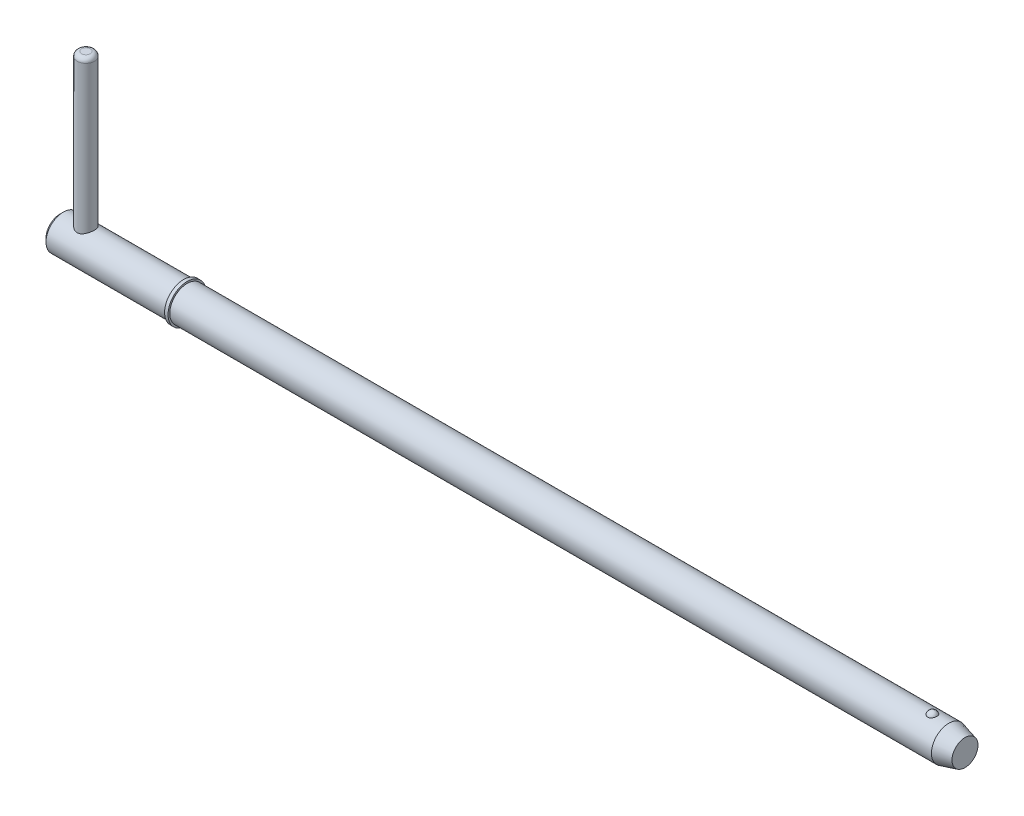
ISO-10303-21;
HEADER;
FILE_DESCRIPTION(('STEP AP214'),'2;1');
FILE_NAME('part.step','',(''),(''),'','','');
FILE_SCHEMA(('AUTOMOTIVE_DESIGN { 1 0 10303 214 1 1 1 1 }'));
ENDSEC;
DATA;
#1=APPLICATION_CONTEXT('core data for automotive mechanical design processes');
#2=APPLICATION_PROTOCOL_DEFINITION('international standard','automotive_design',2000,#1);
#3=PRODUCT_CONTEXT('',#1,'mechanical');
#4=PRODUCT('Part','Part','',(#3));
#5=PRODUCT_RELATED_PRODUCT_CATEGORY('part','',(#4));
#6=PRODUCT_DEFINITION_FORMATION('','',#4);
#7=PRODUCT_DEFINITION_CONTEXT('part definition',#1,'design');
#8=PRODUCT_DEFINITION('design','',#6,#7);
#9=PRODUCT_DEFINITION_SHAPE('','',#8);
#10=(LENGTH_UNIT() NAMED_UNIT(*) SI_UNIT(.MILLI.,.METRE.));
#11=(NAMED_UNIT(*) PLANE_ANGLE_UNIT() SI_UNIT($,.RADIAN.));
#12=(NAMED_UNIT(*) SI_UNIT($,.STERADIAN.) SOLID_ANGLE_UNIT());
#13=UNCERTAINTY_MEASURE_WITH_UNIT(LENGTH_MEASURE(1.E-05),#10,'distance_accuracy_value','');
#14=(GEOMETRIC_REPRESENTATION_CONTEXT(3) GLOBAL_UNCERTAINTY_ASSIGNED_CONTEXT((#13)) GLOBAL_UNIT_ASSIGNED_CONTEXT((#10,
#11,#12)) REPRESENTATION_CONTEXT('',''));
#15=CARTESIAN_POINT('',(0.,0.,0.));
#16=DIRECTION('',(0.,0.,1.));
#17=DIRECTION('',(1.,0.,0.));
#18=AXIS2_PLACEMENT_3D('',#15,#16,#17);
#19=CARTESIAN_POINT('',(3.57,23.02,0.));
#20=DIRECTION('',(0.,-1.,0.));
#21=DIRECTION('',(0.,0.,-1.));
#22=AXIS2_PLACEMENT_3D('',#19,#20,#21);
#23=CYLINDRICAL_SURFACE('',#22,1.19);
#24=CARTESIAN_POINT('',(3.57,-1.785,0.));
#25=DIRECTION('',(0.,1.,0.));
#26=DIRECTION('',(0.,0.,1.));
#27=AXIS2_PLACEMENT_3D('',#24,#25,#26);
#28=CIRCLE('',#27,1.19);
#29=CARTESIAN_POINT('',(3.57,-1.785,1.19));
#30=VERTEX_POINT('',#29);
#31=EDGE_CURVE('P0_E25',#30,#30,#28,.T.);
#32=ORIENTED_EDGE('',*,*,#31,.T.);
#33=EDGE_LOOP('',(#32));
#34=FACE_BOUND('',#33,.T.);
#35=CARTESIAN_POINT('',(3.57,22.425,0.));
#36=DIRECTION('',(0.,1.,0.));
#37=DIRECTION('',(0.,0.,1.));
#38=AXIS2_PLACEMENT_3D('',#35,#36,#37);
#39=CIRCLE('',#38,1.19);
#40=CARTESIAN_POINT('',(3.57,22.425,1.19));
#41=VERTEX_POINT('',#40);
#42=EDGE_CURVE('P0_E29',#41,#41,#39,.F.);
#43=ORIENTED_EDGE('',*,*,#42,.T.);
#44=EDGE_LOOP('',(#43));
#45=FACE_BOUND('',#44,.T.);
#46=ADVANCED_FACE('P0_F14',(#34,#45),#23,.T.);
#47=CARTESIAN_POINT('',(3.57,23.02,0.));
#48=DIRECTION('',(0.,1.,0.));
#49=DIRECTION('',(0.,0.,1.));
#50=AXIS2_PLACEMENT_3D('',#47,#48,#49);
#51=PLANE('',#50);
#52=CARTESIAN_POINT('',(3.57,23.02,0.));
#53=DIRECTION('',(0.,1.,0.));
#54=DIRECTION('',(0.,0.,1.));
#55=AXIS2_PLACEMENT_3D('',#52,#53,#54);
#56=CIRCLE('',#55,0.595);
#57=CARTESIAN_POINT('',(3.57,23.02,0.595));
#58=VERTEX_POINT('',#57);
#59=EDGE_CURVE('P0_E10',#58,#58,#56,.T.);
#60=ORIENTED_EDGE('',*,*,#59,.T.);
#61=EDGE_LOOP('',(#60));
#62=FACE_BOUND('',#61,.T.);
#63=ADVANCED_FACE('P0_F46',(#62),#51,.T.);
#64=CARTESIAN_POINT('',(3.57,-2.38,0.));
#65=DIRECTION('',(0.,1.,0.));
#66=DIRECTION('',(0.,0.,1.));
#67=AXIS2_PLACEMENT_3D('',#64,#65,#66);
#68=PLANE('',#67);
#69=CARTESIAN_POINT('',(3.57,-2.38,0.));
#70=DIRECTION('',(0.,1.,0.));
#71=DIRECTION('',(0.,0.,1.));
#72=AXIS2_PLACEMENT_3D('',#69,#70,#71);
#73=CIRCLE('',#72,0.595);
#74=CARTESIAN_POINT('',(3.57,-2.38,0.595));
#75=VERTEX_POINT('',#74);
#76=EDGE_CURVE('P0_E21',#75,#75,#73,.F.);
#77=ORIENTED_EDGE('',*,*,#76,.T.);
#78=EDGE_LOOP('',(#77));
#79=FACE_BOUND('',#78,.T.);
#80=ADVANCED_FACE('P0_F43',(#79),#68,.F.);
#81=CARTESIAN_POINT('',(3.57,-1.785,0.));
#82=DIRECTION('',(0.,1.,0.));
#83=DIRECTION('',(0.,0.,1.));
#84=AXIS2_PLACEMENT_3D('',#81,#82,#83);
#85=DEGENERATE_TOROIDAL_SURFACE('',#84,0.595,0.595,.T.);
#86=ORIENTED_EDGE('',*,*,#76,.F.);
#87=EDGE_LOOP('',(#86));
#88=FACE_BOUND('',#87,.T.);
#89=ORIENTED_EDGE('',*,*,#31,.F.);
#90=EDGE_LOOP('',(#89));
#91=FACE_BOUND('',#90,.T.);
#92=ADVANCED_FACE('P0_F38',(#88,#91),#85,.T.);
#93=CARTESIAN_POINT('',(3.57,22.425,0.));
#94=DIRECTION('',(0.,1.,0.));
#95=DIRECTION('',(0.,0.,1.));
#96=AXIS2_PLACEMENT_3D('',#93,#94,#95);
#97=DEGENERATE_TOROIDAL_SURFACE('',#96,0.595,0.595,.T.);
#98=ORIENTED_EDGE('',*,*,#42,.F.);
#99=EDGE_LOOP('',(#98));
#100=FACE_BOUND('',#99,.T.);
#101=ORIENTED_EDGE('',*,*,#59,.F.);
#102=EDGE_LOOP('',(#101));
#103=FACE_BOUND('',#102,.T.);
#104=ADVANCED_FACE('P0_F16',(#100,#103),#97,.T.);
#105=CLOSED_SHELL('',(#46,#63,#80,#92,#104));
#106=MANIFOLD_SOLID_BREP('P0_B1',#105);
#107=CARTESIAN_POINT('',(0.,0.,0.));
#108=DIRECTION('',(1.,0.,0.));
#109=DIRECTION('',(0.,0.,-1.));
#110=AXIS2_PLACEMENT_3D('',#107,#108,#109);
#111=CYLINDRICAL_SURFACE('',#110,2.38);
#112=CARTESIAN_POINT('',(121.909429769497,0.,0.));
#113=DIRECTION('',(1.,0.,0.));
#114=DIRECTION('',(0.,0.,-1.));
#115=AXIS2_PLACEMENT_3D('',#112,#113,#114);
#116=CIRCLE('',#115,2.38);
#117=CARTESIAN_POINT('',(121.909429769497,0.,-2.38));
#118=VERTEX_POINT('',#117);
#119=EDGE_CURVE('P1_E81',#118,#118,#116,.T.);
#120=ORIENTED_EDGE('',*,*,#119,.F.);
#121=EDGE_LOOP('',(#120));
#122=FACE_BOUND('',#121,.T.);
#123=CARTESIAN_POINT('',(17.45,0.,0.));
#124=DIRECTION('',(1.,0.,0.));
#125=DIRECTION('',(0.,0.,-1.));
#126=AXIS2_PLACEMENT_3D('',#123,#124,#125);
#127=CIRCLE('',#126,2.38);
#128=CARTESIAN_POINT('',(17.45,0.,-2.38));
#129=VERTEX_POINT('',#128);
#130=EDGE_CURVE('P1_E85',#129,#129,#127,.T.);
#131=ORIENTED_EDGE('',*,*,#130,.T.);
#132=EDGE_LOOP('',(#131));
#133=FACE_BOUND('',#132,.T.);
#134=CARTESIAN_POINT('',(119.663449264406,2.2921568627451,0.640637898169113));
#135=CARTESIAN_POINT('',(119.630355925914,2.29215737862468,0.64063719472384));
#136=CARTESIAN_POINT('',(119.597254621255,2.29293179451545,0.637884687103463));
#137=CARTESIAN_POINT('',(119.532017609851,2.29594030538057,0.626968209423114));
#138=CARTESIAN_POINT('',(119.499882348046,2.29817506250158,0.618801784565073));
#139=CARTESIAN_POINT('',(119.437540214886,2.3038430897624,0.597351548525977));
#140=CARTESIAN_POINT('',(119.40733051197,2.30727454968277,0.584075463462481));
#141=CARTESIAN_POINT('',(119.349567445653,2.31495941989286,0.552829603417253));
#142=CARTESIAN_POINT('',(119.32201418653,2.31921286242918,0.534859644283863));
#143=CARTESIAN_POINT('',(119.269593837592,2.32820213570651,0.494282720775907));
#144=CARTESIAN_POINT('',(119.244805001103,2.33294694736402,0.471576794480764));
#145=CARTESIAN_POINT('',(119.199216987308,2.34234144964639,0.422446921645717));
#146=CARTESIAN_POINT('',(119.178418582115,2.34699112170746,0.396022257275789));
#147=CARTESIAN_POINT('',(119.14035804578,2.35593942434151,0.338855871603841));
#148=CARTESIAN_POINT('',(119.123305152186,2.36021170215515,0.307970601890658));
#149=CARTESIAN_POINT('',(119.0943607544,2.3677057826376,0.243750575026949));
#150=CARTESIAN_POINT('',(119.0824701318,2.37092740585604,0.210415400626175));
#151=CARTESIAN_POINT('',(119.063807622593,2.37606901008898,0.141189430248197));
#152=CARTESIAN_POINT('',(119.057195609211,2.37794816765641,0.105252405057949));
#153=CARTESIAN_POINT('',(119.049809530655,2.38005135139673,0.032735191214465));
#154=CARTESIAN_POINT('',(119.049035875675,2.38027526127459,-0.00384504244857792));
#155=CARTESIAN_POINT('',(119.053362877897,2.37903842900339,-0.0769838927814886));
#156=CARTESIAN_POINT('',(119.05852028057,2.37756141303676,-0.113538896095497));
#157=CARTESIAN_POINT('',(119.074701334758,2.37305303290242,-0.185229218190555));
#158=CARTESIAN_POINT('',(119.085725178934,2.37002161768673,-0.220364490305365));
#159=CARTESIAN_POINT('',(119.113397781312,2.36273722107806,-0.288156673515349));
#160=CARTESIAN_POINT('',(119.130038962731,2.35848588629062,-0.320816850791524));
#161=CARTESIAN_POINT('',(119.168598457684,2.34923130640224,-0.382744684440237));
#162=CARTESIAN_POINT('',(119.190516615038,2.34422808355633,-0.412012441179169));
#163=CARTESIAN_POINT('',(119.238754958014,2.33412555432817,-0.465830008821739));
#164=CARTESIAN_POINT('',(119.265002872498,2.32902887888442,-0.490444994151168));
#165=CARTESIAN_POINT('',(119.321476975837,2.31926941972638,-0.534700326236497));
#166=CARTESIAN_POINT('',(119.351702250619,2.3146065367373,-0.554341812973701));
#167=CARTESIAN_POINT('',(119.414061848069,2.30645675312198,-0.587312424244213));
#168=CARTESIAN_POINT('',(119.446078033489,2.30293152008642,-0.600855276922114));
#169=CARTESIAN_POINT('',(119.512079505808,2.29725171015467,-0.622220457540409));
#170=CARTESIAN_POINT('',(119.546064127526,2.29509667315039,-0.630044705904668));
#171=CARTESIAN_POINT('',(119.613299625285,2.29249264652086,-0.639452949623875));
#172=CARTESIAN_POINT('',(119.646508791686,2.29196755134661,-0.641315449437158));
#173=CARTESIAN_POINT('',(119.712763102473,2.29246849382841,-0.63952261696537));
#174=CARTESIAN_POINT('',(119.745808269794,2.29349430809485,-0.635868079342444));
#175=CARTESIAN_POINT('',(119.810102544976,2.29694059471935,-0.623301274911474));
#176=CARTESIAN_POINT('',(119.841374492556,2.29933234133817,-0.614497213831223));
#177=CARTESIAN_POINT('',(119.901995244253,2.30522511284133,-0.592006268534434));
#178=CARTESIAN_POINT('',(119.931343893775,2.30872622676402,-0.578318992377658));
#179=CARTESIAN_POINT('',(119.988036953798,2.31655795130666,-0.546112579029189));
#180=CARTESIAN_POINT('',(120.015320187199,2.32090569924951,-0.52749010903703));
#181=CARTESIAN_POINT('',(120.066490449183,2.3299220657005,-0.486117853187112));
#182=CARTESIAN_POINT('',(120.090376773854,2.33459075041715,-0.463367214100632));
#183=CARTESIAN_POINT('',(120.135272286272,2.34399834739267,-0.41322006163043));
#184=CARTESIAN_POINT('',(120.156097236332,2.34873051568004,-0.38565730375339));
#185=CARTESIAN_POINT('',(120.193056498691,2.35754932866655,-0.327455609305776));
#186=CARTESIAN_POINT('',(120.209189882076,2.36163584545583,-0.296816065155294));
#187=CARTESIAN_POINT('',(120.2369822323,2.36889321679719,-0.232047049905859));
#188=CARTESIAN_POINT('',(120.248445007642,2.37202275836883,-0.197828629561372));
#189=CARTESIAN_POINT('',(120.265752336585,2.37681926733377,-0.127900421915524));
#190=CARTESIAN_POINT('',(120.271596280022,2.37848607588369,-0.092190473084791));
#191=CARTESIAN_POINT('',(120.277605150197,2.38020024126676,-0.0196348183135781));
#192=CARTESIAN_POINT('',(120.27767043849,2.38021918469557,0.0172198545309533));
#193=CARTESIAN_POINT('',(120.271868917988,2.37856356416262,0.0904219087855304));
#194=CARTESIAN_POINT('',(120.266001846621,2.37688892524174,0.126769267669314));
#195=CARTESIAN_POINT('',(120.248425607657,2.37201688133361,0.198028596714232));
#196=CARTESIAN_POINT('',(120.236699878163,2.36881516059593,0.232936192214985));
#197=CARTESIAN_POINT('',(120.20763544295,2.36123444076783,0.300196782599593));
#198=CARTESIAN_POINT('',(120.190296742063,2.3568554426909,0.332549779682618));
#199=CARTESIAN_POINT('',(120.150535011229,2.34744667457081,0.39349541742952));
#200=CARTESIAN_POINT('',(120.128152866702,2.34242227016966,0.422115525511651));
#201=CARTESIAN_POINT('',(120.078739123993,2.33227293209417,0.475004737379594));
#202=CARTESIAN_POINT('',(120.051707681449,2.32714800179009,0.499273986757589));
#203=CARTESIAN_POINT('',(119.994498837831,2.31755359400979,0.542046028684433));
#204=CARTESIAN_POINT('',(119.96442973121,2.3130698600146,0.560690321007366));
#205=CARTESIAN_POINT('',(119.901386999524,2.30514125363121,0.592447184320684));
#206=CARTESIAN_POINT('',(119.868415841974,2.30169550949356,0.605564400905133));
#207=CARTESIAN_POINT('',(119.806842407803,2.29677744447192,0.623927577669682));
#208=CARTESIAN_POINT('',(119.778555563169,2.295058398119,0.630178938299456));
#209=CARTESIAN_POINT('',(119.721330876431,2.29274795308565,0.638534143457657));
#210=CARTESIAN_POINT('',(119.692393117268,2.29215641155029,0.640638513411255));
#211=CARTESIAN_POINT('',(119.663449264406,2.2921568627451,0.640637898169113));
#212=B_SPLINE_CURVE_WITH_KNOTS('',3,(#134,#135,#136,#137,#138,#139,#140,#141,#142,#143,#144,
#145,#146,#147,#148,#149,#150,#151,#152,#153,#154,#155,#156,#157,#158,#159,#160,#161,#162,#163,
#164,#165,#166,#167,#168,#169,#170,#171,#172,#173,#174,#175,#176,#177,#178,#179,#180,#181,#182,
#183,#184,#185,#186,#187,#188,#189,#190,#191,#192,#193,#194,#195,#196,#197,#198,#199,#200,#201,
#202,#203,#204,#205,#206,#207,#208,#209,#210,#211),.UNSPECIFIED.,.T.,.F.,(4,2,2,2,2,2,2,2,2,2,2,
2,2,2,2,2,2,2,2,2,2,2,2,2,2,2,2,2,2,2,2,2,2,2,2,2,2,2,4),(0.,0.0991724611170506,
0.198389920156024,0.297457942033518,0.396529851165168,0.497927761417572,0.59934527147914,
0.70547553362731,0.811623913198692,0.920876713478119,1.03013718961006,1.14045177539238,
1.25076998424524,1.36093998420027,1.47110672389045,1.57959248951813,1.68805336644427,
1.79234266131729,1.89659691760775,1.9959039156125,2.09519661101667,2.19247425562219,
2.2897597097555,2.38926978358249,2.48880044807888,2.59293588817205,2.69709193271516,
2.80525821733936,2.91343624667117,3.0234791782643,3.13352698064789,3.24388765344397,
3.35424823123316,3.46374443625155,3.5732369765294,3.67968690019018,3.78604717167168,
3.87279565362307,3.9595331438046),.UNSPECIFIED.);
#213=CARTESIAN_POINT('',(119.663449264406,2.2921568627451,0.640637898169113));
#214=VERTEX_POINT('',#213);
#215=EDGE_CURVE('P1_E35',#214,#214,#212,.T.);
#216=ORIENTED_EDGE('',*,*,#215,.T.);
#217=EDGE_LOOP('',(#216));
#218=FACE_BOUND('',#217,.T.);
#219=ADVANCED_FACE('P1_F13',(#122,#133,#218),#111,.T.);
#220=CARTESIAN_POINT('',(0.,0.,0.));
#221=DIRECTION('',(-1.,0.,0.));
#222=DIRECTION('',(0.,0.,1.));
#223=AXIS2_PLACEMENT_3D('',#220,#221,#222);
#224=PLANE('',#223);
#225=CARTESIAN_POINT('',(0.,0.,0.));
#226=DIRECTION('',(1.,0.,0.));
#227=DIRECTION('',(0.,0.,-1.));
#228=AXIS2_PLACEMENT_3D('',#225,#226,#227);
#229=CIRCLE('',#228,1.904);
#230=CARTESIAN_POINT('',(0.,0.,-1.904));
#231=VERTEX_POINT('',#230);
#232=EDGE_CURVE('P1_E9',#231,#231,#229,.T.);
#233=ORIENTED_EDGE('',*,*,#232,.F.);
#234=EDGE_LOOP('',(#233));
#235=FACE_BOUND('',#234,.T.);
#236=ADVANCED_FACE('P1_F15',(#235),#224,.T.);
#237=CARTESIAN_POINT('',(0.475999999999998,0.,0.));
#238=DIRECTION('',(1.,0.,0.));
#239=DIRECTION('',(0.,0.,-1.));
#240=AXIS2_PLACEMENT_3D('',#237,#238,#239);
#241=CONICAL_SURFACE('',#240,2.38,0.78539816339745);
#242=ORIENTED_EDGE('',*,*,#232,.T.);
#243=EDGE_LOOP('',(#242));
#244=FACE_BOUND('',#243,.T.);
#245=CARTESIAN_POINT('',(0.475999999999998,0.,0.));
#246=DIRECTION('',(1.,0.,0.));
#247=DIRECTION('',(0.,0.,-1.));
#248=AXIS2_PLACEMENT_3D('',#245,#246,#247);
#249=CIRCLE('',#248,2.38);
#250=CARTESIAN_POINT('',(0.475999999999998,0.,-2.38));
#251=VERTEX_POINT('',#250);
#252=EDGE_CURVE('P1_E26',#251,#251,#249,.T.);
#253=ORIENTED_EDGE('',*,*,#252,.F.);
#254=EDGE_LOOP('',(#253));
#255=FACE_BOUND('',#254,.T.);
#256=ADVANCED_FACE('P1_F77',(#244,#255),#241,.T.);
#257=CARTESIAN_POINT('',(0.,0.,0.));
#258=DIRECTION('',(1.,0.,0.));
#259=DIRECTION('',(0.,0.,-1.));
#260=AXIS2_PLACEMENT_3D('',#257,#258,#259);
#261=CYLINDRICAL_SURFACE('',#260,2.38);
#262=CARTESIAN_POINT('',(3.57,-2.06114046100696,1.19));
#263=CARTESIAN_POINT('',(3.50799170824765,-2.06114586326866,1.18999567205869));
#264=CARTESIAN_POINT('',(3.4459051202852,-2.0639812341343,1.18512096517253));
#265=CARTESIAN_POINT('',(3.32363755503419,-2.07491216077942,1.16587061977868));
#266=CARTESIAN_POINT('',(3.26346086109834,-2.08301876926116,1.15147501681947));
#267=CARTESIAN_POINT('',(3.14701251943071,-2.10331722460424,1.11395893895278));
#268=CARTESIAN_POINT('',(3.09072196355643,-2.1154873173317,1.09088484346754));
#269=CARTESIAN_POINT('',(2.9828251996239,-2.14250771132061,1.03680835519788));
#270=CARTESIAN_POINT('',(2.93121924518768,-2.15735815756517,1.00580553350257));
#271=CARTESIAN_POINT('',(2.82945618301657,-2.18956274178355,0.933753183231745));
#272=CARTESIAN_POINT('',(2.77976962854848,-2.20702235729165,0.892085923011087));
#273=CARTESIAN_POINT('',(2.68772401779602,-2.2416265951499,0.801172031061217));
#274=CARTESIAN_POINT('',(2.64536861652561,-2.25877105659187,0.751921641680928));
#275=CARTESIAN_POINT('',(2.56639309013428,-2.29219557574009,0.64318258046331));
#276=CARTESIAN_POINT('',(2.53035201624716,-2.30833946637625,0.583227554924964));
#277=CARTESIAN_POINT('',(2.46908238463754,-2.3365739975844,0.45714686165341));
#278=CARTESIAN_POINT('',(2.44384700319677,-2.34866719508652,0.391025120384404));
#279=CARTESIAN_POINT('',(2.40676945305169,-2.36667748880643,0.259473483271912));
#280=CARTESIAN_POINT('',(2.39410206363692,-2.37297281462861,0.194329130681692));
#281=CARTESIAN_POINT('',(2.3798023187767,-2.3800902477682,0.0625590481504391));
#282=CARTESIAN_POINT('',(2.37816328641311,-2.38091566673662,-0.00406576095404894));
#283=CARTESIAN_POINT('',(2.38564854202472,-2.37717948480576,-0.130700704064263));
#284=CARTESIAN_POINT('',(2.39384923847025,-2.37308010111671,-0.190782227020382));
#285=CARTESIAN_POINT('',(2.41912820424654,-2.360653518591,-0.308583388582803));
#286=CARTESIAN_POINT('',(2.43620713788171,-2.35232600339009,-0.366302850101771));
#287=CARTESIAN_POINT('',(2.47886825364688,-2.33206184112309,-0.478748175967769));
#288=CARTESIAN_POINT('',(2.50456481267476,-2.32007685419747,-0.533421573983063));
#289=CARTESIAN_POINT('',(2.56357346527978,-2.29357798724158,-0.637812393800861));
#290=CARTESIAN_POINT('',(2.5968882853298,-2.27906320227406,-0.687528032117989));
#291=CARTESIAN_POINT('',(2.67380546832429,-2.24724829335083,-0.785606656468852));
#292=CARTESIAN_POINT('',(2.71808260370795,-2.22981457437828,-0.833397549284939));
#293=CARTESIAN_POINT('',(2.81386177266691,-2.19500665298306,-0.921184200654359));
#294=CARTESIAN_POINT('',(2.86536931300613,-2.17763250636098,-0.961173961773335));
#295=CARTESIAN_POINT('',(2.97815134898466,-2.14371545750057,-1.03471134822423));
#296=CARTESIAN_POINT('',(3.03983836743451,-2.12729540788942,-1.06768860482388));
#297=CARTESIAN_POINT('',(3.16889582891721,-2.09886785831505,-1.12254974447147));
#298=CARTESIAN_POINT('',(3.2362602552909,-2.0868557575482,-1.14444520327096));
#299=CARTESIAN_POINT('',(3.36914526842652,-2.06994116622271,-1.1747444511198));
#300=CARTESIAN_POINT('',(3.43438893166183,-2.06455070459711,-1.18407989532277));
#301=CARTESIAN_POINT('',(3.56571759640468,-2.06010324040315,-1.1918051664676));
#302=CARTESIAN_POINT('',(3.63180197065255,-2.06104176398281,-1.19020272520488));
#303=CARTESIAN_POINT('',(3.75522816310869,-2.06862860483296,-1.17695289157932));
#304=CARTESIAN_POINT('',(3.81273554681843,-2.07464109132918,-1.16642350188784));
#305=CARTESIAN_POINT('',(3.92505766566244,-2.09075885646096,-1.1372785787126));
#306=CARTESIAN_POINT('',(3.97987152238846,-2.1008654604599,-1.1186604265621));
#307=CARTESIAN_POINT('',(4.08813948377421,-2.12458104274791,-1.07296063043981));
#308=CARTESIAN_POINT('',(4.14141303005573,-2.13833055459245,-1.04552693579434));
#309=CARTESIAN_POINT('',(4.2429084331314,-2.16765782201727,-0.983281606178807));
#310=CARTESIAN_POINT('',(4.29112767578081,-2.18323651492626,-0.948466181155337));
#311=CARTESIAN_POINT('',(4.38750473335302,-2.2168271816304,-0.867316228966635));
#312=CARTESIAN_POINT('',(4.43488860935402,-2.23489833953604,-0.82008287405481));
#313=CARTESIAN_POINT('',(4.52130056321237,-2.26973739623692,-0.718051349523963));
#314=CARTESIAN_POINT('',(4.56032581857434,-2.28650485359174,-0.663250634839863));
#315=CARTESIAN_POINT('',(4.62978273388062,-2.31742220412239,-0.545657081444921));
#316=CARTESIAN_POINT('',(4.65996041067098,-2.33149133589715,-0.482691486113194));
#317=CARTESIAN_POINT('',(4.7089941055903,-2.35481192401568,-0.351671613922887));
#318=CARTESIAN_POINT('',(4.7278600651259,-2.36406760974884,-0.283621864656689));
#319=CARTESIAN_POINT('',(4.75210859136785,-2.3760433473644,-0.151105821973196));
#320=CARTESIAN_POINT('',(4.75856947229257,-2.37928514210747,-0.0868836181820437));
#321=CARTESIAN_POINT('',(4.76100348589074,-2.38050135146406,0.0417999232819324));
#322=CARTESIAN_POINT('',(4.75698028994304,-2.37847760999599,0.106261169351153));
#323=CARTESIAN_POINT('',(4.73927447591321,-2.36969422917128,0.229120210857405));
#324=CARTESIAN_POINT('',(4.72624582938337,-2.36325544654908,0.287637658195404));
#325=CARTESIAN_POINT('',(4.69178087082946,-2.34658591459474,0.401560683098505));
#326=CARTESIAN_POINT('',(4.67034335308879,-2.33635462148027,0.456965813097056));
#327=CARTESIAN_POINT('',(4.61871480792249,-2.31247857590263,0.565753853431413));
#328=CARTESIAN_POINT('',(4.58818860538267,-2.29870654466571,0.618948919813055));
#329=CARTESIAN_POINT('',(4.51967006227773,-2.26918878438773,0.719681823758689));
#330=CARTESIAN_POINT('',(4.48167429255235,-2.25344215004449,0.76721704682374));
#331=CARTESIAN_POINT('',(4.39491140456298,-2.21969046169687,0.860267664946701));
#332=CARTESIAN_POINT('',(4.34544863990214,-2.20161660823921,0.905111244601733));
#333=CARTESIAN_POINT('',(4.23943364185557,-2.16655060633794,0.986109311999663));
#334=CARTESIAN_POINT('',(4.18287520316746,-2.1495594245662,1.02225611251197));
#335=CARTESIAN_POINT('',(4.06190239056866,-2.1181953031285,1.08579298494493));
#336=CARTESIAN_POINT('',(3.9972962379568,-2.10392207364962,1.11287022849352));
#337=CARTESIAN_POINT('',(3.86353443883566,-2.08090726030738,1.15534566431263));
#338=CARTESIAN_POINT('',(3.7943948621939,-2.07214719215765,1.17078291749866));
#339=CARTESIAN_POINT('',(3.69875162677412,-2.06499834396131,1.18329673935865));
#340=CARTESIAN_POINT('',(3.67309220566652,-2.06355673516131,1.18580656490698));
#341=CARTESIAN_POINT('',(3.62162638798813,-2.06162663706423,1.18915915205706));
#342=CARTESIAN_POINT('',(3.59581998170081,-2.0611382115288,1.19000180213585));
#343=CARTESIAN_POINT('',(3.57,-2.06114046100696,1.19));
#344=B_SPLINE_CURVE_WITH_KNOTS('',3,(#262,#263,#264,#265,#266,#267,#268,#269,#270,#271,#272,
#273,#274,#275,#276,#277,#278,#279,#280,#281,#282,#283,#284,#285,#286,#287,#288,#289,#290,#291,
#292,#293,#294,#295,#296,#297,#298,#299,#300,#301,#302,#303,#304,#305,#306,#307,#308,#309,#310,
#311,#312,#313,#314,#315,#316,#317,#318,#319,#320,#321,#322,#323,#324,#325,#326,#327,#328,#329,
#330,#331,#332,#333,#334,#335,#336,#337,#338,#339,#340,#341,#342,#343),.UNSPECIFIED.,.T.,.F.,(4,
2,2,2,2,2,2,2,2,2,2,2,2,2,2,2,2,2,2,2,2,2,2,2,2,2,2,2,2,2,2,2,2,2,2,2,2,2,2,2,4),(0.,
0.185916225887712,0.372223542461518,0.557549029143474,0.742884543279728,0.943506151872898,
1.14422749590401,1.35847891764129,1.5725948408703,1.77147547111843,1.97023568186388,
2.15171156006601,2.33320101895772,2.51720146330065,2.70126786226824,2.902733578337,
3.10435357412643,3.31877721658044,3.53297641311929,3.73020126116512,3.92728670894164,
4.1028127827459,4.27839572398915,4.46211082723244,4.64592048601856,4.8529002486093,
5.0599497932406,5.27246375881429,5.48479067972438,5.67763601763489,5.87041383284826,
6.05048865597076,6.23058930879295,6.41839293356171,6.60628297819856,6.8128718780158,
7.01964271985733,7.2329479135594,7.44553408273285,7.52294360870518,7.60035831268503),.UNSPECIFIED.);
#345=CARTESIAN_POINT('',(3.57,-2.06114046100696,1.19));
#346=VERTEX_POINT('',#345);
#347=EDGE_CURVE('P1_E17',#346,#346,#344,.T.);
#348=ORIENTED_EDGE('',*,*,#347,.F.);
#349=EDGE_LOOP('',(#348));
#350=FACE_BOUND('',#349,.T.);
#351=CARTESIAN_POINT('',(3.57,2.06114046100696,1.19));
#352=CARTESIAN_POINT('',(3.63200829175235,2.06114586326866,1.18999567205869));
#353=CARTESIAN_POINT('',(3.6940948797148,2.0639812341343,1.18512096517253));
#354=CARTESIAN_POINT('',(3.81636244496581,2.07491216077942,1.16587061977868));
#355=CARTESIAN_POINT('',(3.87653913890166,2.08301876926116,1.15147501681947));
#356=CARTESIAN_POINT('',(3.99298748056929,2.10331722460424,1.11395893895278));
#357=CARTESIAN_POINT('',(4.04927803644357,2.1154873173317,1.09088484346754));
#358=CARTESIAN_POINT('',(4.1571748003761,2.14250771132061,1.03680835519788));
#359=CARTESIAN_POINT('',(4.20878075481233,2.15735815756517,1.00580553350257));
#360=CARTESIAN_POINT('',(4.31054381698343,2.18956274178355,0.933753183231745));
#361=CARTESIAN_POINT('',(4.36023037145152,2.20702235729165,0.892085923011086));
#362=CARTESIAN_POINT('',(4.45227598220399,2.2416265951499,0.801172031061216));
#363=CARTESIAN_POINT('',(4.49463138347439,2.25877105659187,0.751921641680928));
#364=CARTESIAN_POINT('',(4.57360690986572,2.29219557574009,0.643182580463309));
#365=CARTESIAN_POINT('',(4.60964798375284,2.30833946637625,0.583227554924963));
#366=CARTESIAN_POINT('',(4.67091761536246,2.3365739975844,0.457146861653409));
#367=CARTESIAN_POINT('',(4.69615299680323,2.34866719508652,0.391025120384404));
#368=CARTESIAN_POINT('',(4.73323054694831,2.36667748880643,0.259473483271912));
#369=CARTESIAN_POINT('',(4.74589793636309,2.37297281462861,0.194329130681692));
#370=CARTESIAN_POINT('',(4.7601976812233,2.3800902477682,0.0625590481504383));
#371=CARTESIAN_POINT('',(4.76183671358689,2.38091566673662,-0.00406576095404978));
#372=CARTESIAN_POINT('',(4.75435145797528,2.37717948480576,-0.130700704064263));
#373=CARTESIAN_POINT('',(4.74615076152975,2.37308010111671,-0.190782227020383));
#374=CARTESIAN_POINT('',(4.72087179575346,2.360653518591,-0.308583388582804));
#375=CARTESIAN_POINT('',(4.70379286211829,2.35232600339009,-0.366302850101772));
#376=CARTESIAN_POINT('',(4.66113174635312,2.33206184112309,-0.478748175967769));
#377=CARTESIAN_POINT('',(4.63543518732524,2.32007685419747,-0.533421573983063));
#378=CARTESIAN_POINT('',(4.57642653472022,2.29357798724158,-0.637812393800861));
#379=CARTESIAN_POINT('',(4.5431117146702,2.27906320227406,-0.687528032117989));
#380=CARTESIAN_POINT('',(4.46619453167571,2.24724829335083,-0.785606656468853));
#381=CARTESIAN_POINT('',(4.42191739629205,2.22981457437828,-0.83339754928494));
#382=CARTESIAN_POINT('',(4.32613822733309,2.19500665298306,-0.921184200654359));
#383=CARTESIAN_POINT('',(4.27463068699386,2.17763250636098,-0.961173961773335));
#384=CARTESIAN_POINT('',(4.16184865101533,2.14371545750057,-1.03471134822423));
#385=CARTESIAN_POINT('',(4.10016163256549,2.12729540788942,-1.06768860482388));
#386=CARTESIAN_POINT('',(3.97110417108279,2.09886785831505,-1.12254974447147));
#387=CARTESIAN_POINT('',(3.9037397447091,2.0868557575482,-1.14444520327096));
#388=CARTESIAN_POINT('',(3.77085473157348,2.06994116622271,-1.1747444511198));
#389=CARTESIAN_POINT('',(3.70561106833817,2.06455070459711,-1.18407989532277));
#390=CARTESIAN_POINT('',(3.57428240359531,2.06010324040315,-1.1918051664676));
#391=CARTESIAN_POINT('',(3.50819802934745,2.06104176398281,-1.19020272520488));
#392=CARTESIAN_POINT('',(3.38477183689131,2.06862860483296,-1.17695289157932));
#393=CARTESIAN_POINT('',(3.32726445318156,2.07464109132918,-1.16642350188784));
#394=CARTESIAN_POINT('',(3.21494233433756,2.09075885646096,-1.1372785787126));
#395=CARTESIAN_POINT('',(3.16012847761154,2.1008654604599,-1.1186604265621));
#396=CARTESIAN_POINT('',(3.05186051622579,2.12458104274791,-1.07296063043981));
#397=CARTESIAN_POINT('',(2.99858696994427,2.13833055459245,-1.04552693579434));
#398=CARTESIAN_POINT('',(2.8970915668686,2.16765782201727,-0.983281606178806));
#399=CARTESIAN_POINT('',(2.84887232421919,2.18323651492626,-0.948466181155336));
#400=CARTESIAN_POINT('',(2.75249526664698,2.2168271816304,-0.867316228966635));
#401=CARTESIAN_POINT('',(2.70511139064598,2.23489833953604,-0.820082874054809));
#402=CARTESIAN_POINT('',(2.61869943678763,2.26973739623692,-0.718051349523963));
#403=CARTESIAN_POINT('',(2.57967418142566,2.28650485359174,-0.663250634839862));
#404=CARTESIAN_POINT('',(2.51021726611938,2.31742220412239,-0.54565708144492));
#405=CARTESIAN_POINT('',(2.48003958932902,2.33149133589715,-0.482691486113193));
#406=CARTESIAN_POINT('',(2.4310058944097,2.35481192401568,-0.351671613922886));
#407=CARTESIAN_POINT('',(2.4121399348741,2.36406760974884,-0.283621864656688));
#408=CARTESIAN_POINT('',(2.38789140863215,2.3760433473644,-0.151105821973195));
#409=CARTESIAN_POINT('',(2.38143052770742,2.37928514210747,-0.0868836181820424));
#410=CARTESIAN_POINT('',(2.37899651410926,2.38050135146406,0.0417999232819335));
#411=CARTESIAN_POINT('',(2.38301971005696,2.37847760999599,0.106261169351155));
#412=CARTESIAN_POINT('',(2.40072552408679,2.36969422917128,0.229120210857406));
#413=CARTESIAN_POINT('',(2.41375417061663,2.36325544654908,0.287637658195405));
#414=CARTESIAN_POINT('',(2.44821912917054,2.34658591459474,0.401560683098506));
#415=CARTESIAN_POINT('',(2.46965664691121,2.33635462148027,0.456965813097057));
#416=CARTESIAN_POINT('',(2.52128519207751,2.31247857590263,0.565753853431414));
#417=CARTESIAN_POINT('',(2.55181139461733,2.29870654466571,0.618948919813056));
#418=CARTESIAN_POINT('',(2.62032993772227,2.26918878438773,0.719681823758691));
#419=CARTESIAN_POINT('',(2.65832570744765,2.25344215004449,0.767217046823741));
#420=CARTESIAN_POINT('',(2.74508859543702,2.21969046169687,0.860267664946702));
#421=CARTESIAN_POINT('',(2.79455136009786,2.20161660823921,0.905111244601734));
#422=CARTESIAN_POINT('',(2.90056635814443,2.16655060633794,0.986109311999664));
#423=CARTESIAN_POINT('',(2.95712479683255,2.1495594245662,1.02225611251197));
#424=CARTESIAN_POINT('',(3.07809760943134,2.1181953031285,1.08579298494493));
#425=CARTESIAN_POINT('',(3.1427037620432,2.10392207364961,1.11287022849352));
#426=CARTESIAN_POINT('',(3.27646556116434,2.08090726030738,1.15534566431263));
#427=CARTESIAN_POINT('',(3.3456051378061,2.07214719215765,1.17078291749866));
#428=CARTESIAN_POINT('',(3.44124837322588,2.06499834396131,1.18329673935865));
#429=CARTESIAN_POINT('',(3.46690779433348,2.06355673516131,1.18580656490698));
#430=CARTESIAN_POINT('',(3.51837361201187,2.06162663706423,1.18915915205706));
#431=CARTESIAN_POINT('',(3.54418001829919,2.0611382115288,1.19000180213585));
#432=CARTESIAN_POINT('',(3.57,2.06114046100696,1.19));
#433=B_SPLINE_CURVE_WITH_KNOTS('',3,(#351,#352,#353,#354,#355,#356,#357,#358,#359,#360,#361,
#362,#363,#364,#365,#366,#367,#368,#369,#370,#371,#372,#373,#374,#375,#376,#377,#378,#379,#380,
#381,#382,#383,#384,#385,#386,#387,#388,#389,#390,#391,#392,#393,#394,#395,#396,#397,#398,#399,
#400,#401,#402,#403,#404,#405,#406,#407,#408,#409,#410,#411,#412,#413,#414,#415,#416,#417,#418,
#419,#420,#421,#422,#423,#424,#425,#426,#427,#428,#429,#430,#431,#432),.UNSPECIFIED.,.T.,.F.,(4,
2,2,2,2,2,2,2,2,2,2,2,2,2,2,2,2,2,2,2,2,2,2,2,2,2,2,2,2,2,2,2,2,2,2,2,2,2,2,2,4),(0.,
0.185916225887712,0.372223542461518,0.557549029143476,0.74288454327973,0.9435061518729,
1.14422749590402,1.35847891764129,1.5725948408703,1.77147547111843,1.97023568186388,
2.15171156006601,2.33320101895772,2.51720146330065,2.70126786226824,2.902733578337,
3.10435357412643,3.31877721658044,3.53297641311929,3.73020126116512,3.92728670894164,
4.1028127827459,4.27839572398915,4.46211082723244,4.64592048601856,4.8529002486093,
5.05994979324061,5.27246375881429,5.48479067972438,5.67763601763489,5.87041383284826,
6.05048865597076,6.23058930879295,6.41839293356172,6.60628297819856,6.8128718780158,
7.01964271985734,7.2329479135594,7.44553408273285,7.52294360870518,7.60035831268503),.UNSPECIFIED.);
#434=CARTESIAN_POINT('',(3.57,2.06114046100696,1.19));
#435=VERTEX_POINT('',#434);
#436=EDGE_CURVE('P1_E43',#435,#435,#433,.T.);
#437=ORIENTED_EDGE('',*,*,#436,.F.);
#438=EDGE_LOOP('',(#437));
#439=FACE_BOUND('',#438,.T.);
#440=ORIENTED_EDGE('',*,*,#252,.T.);
#441=EDGE_LOOP('',(#440));
#442=FACE_BOUND('',#441,.T.);
#443=CARTESIAN_POINT('',(16.974,0.,0.));
#444=DIRECTION('',(1.,0.,0.));
#445=DIRECTION('',(0.,0.,-1.));
#446=AXIS2_PLACEMENT_3D('',#443,#444,#445);
#447=CIRCLE('',#446,2.38);
#448=CARTESIAN_POINT('',(16.974,0.,-2.38));
#449=VERTEX_POINT('',#448);
#450=EDGE_CURVE('P1_E31',#449,#449,#447,.T.);
#451=ORIENTED_EDGE('',*,*,#450,.F.);
#452=EDGE_LOOP('',(#451));
#453=FACE_BOUND('',#452,.T.);
#454=ADVANCED_FACE('P1_F103',(#350,#439,#442,#453),#261,.T.);
#455=CARTESIAN_POINT('',(16.974,2.38,0.));
#456=DIRECTION('',(-1.,0.,0.));
#457=DIRECTION('',(0.,0.,1.));
#458=AXIS2_PLACEMENT_3D('',#455,#456,#457);
#459=PLANE('',#458);
#460=ORIENTED_EDGE('',*,*,#450,.T.);
#461=EDGE_LOOP('',(#460));
#462=FACE_BOUND('',#461,.T.);
#463=CARTESIAN_POINT('',(16.974,0.,0.));
#464=DIRECTION('',(1.,0.,0.));
#465=DIRECTION('',(0.,0.,-1.));
#466=AXIS2_PLACEMENT_3D('',#463,#464,#465);
#467=CIRCLE('',#466,2.618);
#468=CARTESIAN_POINT('',(16.974,0.,-2.618));
#469=VERTEX_POINT('',#468);
#470=EDGE_CURVE('P1_E91',#469,#469,#467,.T.);
#471=ORIENTED_EDGE('',*,*,#470,.F.);
#472=EDGE_LOOP('',(#471));
#473=FACE_BOUND('',#472,.T.);
#474=ADVANCED_FACE('P1_F100',(#462,#473),#459,.T.);
#475=CARTESIAN_POINT('',(0.,0.,0.));
#476=DIRECTION('',(1.,0.,0.));
#477=DIRECTION('',(0.,0.,-1.));
#478=AXIS2_PLACEMENT_3D('',#475,#476,#477);
#479=CYLINDRICAL_SURFACE('',#478,2.618);
#480=ORIENTED_EDGE('',*,*,#470,.T.);
#481=EDGE_LOOP('',(#480));
#482=FACE_BOUND('',#481,.T.);
#483=CARTESIAN_POINT('',(17.45,0.,0.));
#484=DIRECTION('',(1.,0.,0.));
#485=DIRECTION('',(0.,0.,-1.));
#486=AXIS2_PLACEMENT_3D('',#483,#484,#485);
#487=CIRCLE('',#486,2.618);
#488=CARTESIAN_POINT('',(17.45,0.,-2.618));
#489=VERTEX_POINT('',#488);
#490=EDGE_CURVE('P1_E88',#489,#489,#487,.T.);
#491=ORIENTED_EDGE('',*,*,#490,.F.);
#492=EDGE_LOOP('',(#491));
#493=FACE_BOUND('',#492,.T.);
#494=ADVANCED_FACE('P1_F68',(#482,#493),#479,.T.);
#495=CARTESIAN_POINT('',(17.45,2.618,0.));
#496=DIRECTION('',(1.,0.,0.));
#497=DIRECTION('',(0.,0.,-1.));
#498=AXIS2_PLACEMENT_3D('',#495,#496,#497);
#499=PLANE('',#498);
#500=ORIENTED_EDGE('',*,*,#490,.T.);
#501=EDGE_LOOP('',(#500));
#502=FACE_BOUND('',#501,.T.);
#503=ORIENTED_EDGE('',*,*,#130,.F.);
#504=EDGE_LOOP('',(#503));
#505=FACE_BOUND('',#504,.T.);
#506=ADVANCED_FACE('P1_F62',(#502,#505),#499,.T.);
#507=CARTESIAN_POINT('',(124.13,0.,0.));
#508=DIRECTION('',(-1.,0.,0.));
#509=DIRECTION('',(0.,0.,1.));
#510=AXIS2_PLACEMENT_3D('',#507,#508,#509);
#511=CONICAL_SURFACE('',#510,1.78500000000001,0.261799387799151);
#512=ORIENTED_EDGE('',*,*,#119,.T.);
#513=EDGE_LOOP('',(#512));
#514=FACE_BOUND('',#513,.T.);
#515=CARTESIAN_POINT('',(124.13,0.,0.));
#516=DIRECTION('',(1.,0.,0.));
#517=DIRECTION('',(0.,0.,-1.));
#518=AXIS2_PLACEMENT_3D('',#515,#516,#517);
#519=CIRCLE('',#518,1.78500000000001);
#520=CARTESIAN_POINT('',(124.13,0.,-1.78500000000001));
#521=VERTEX_POINT('',#520);
#522=EDGE_CURVE('P1_E42',#521,#521,#519,.T.);
#523=ORIENTED_EDGE('',*,*,#522,.F.);
#524=EDGE_LOOP('',(#523));
#525=FACE_BOUND('',#524,.T.);
#526=ADVANCED_FACE('P1_F59',(#514,#525),#511,.T.);
#527=CARTESIAN_POINT('',(124.13,1.78500000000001,0.));
#528=DIRECTION('',(1.,0.,0.));
#529=DIRECTION('',(0.,0.,-1.));
#530=AXIS2_PLACEMENT_3D('',#527,#528,#529);
#531=PLANE('',#530);
#532=ORIENTED_EDGE('',*,*,#522,.T.);
#533=EDGE_LOOP('',(#532));
#534=FACE_BOUND('',#533,.T.);
#535=ADVANCED_FACE('P1_F55',(#534),#531,.T.);
#536=CARTESIAN_POINT('',(119.663449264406,2.142,0.));
#537=DIRECTION('',(-1.,0.,0.));
#538=DIRECTION('',(0.,1.,0.));
#539=AXIS2_PLACEMENT_3D('',#536,#537,#538);
#540=SPHERICAL_SURFACE('',#539,0.657999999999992);
#541=ORIENTED_EDGE('',*,*,#215,.F.);
#542=EDGE_LOOP('',(#541));
#543=FACE_BOUND('',#542,.T.);
#544=ADVANCED_FACE('P1_F50',(#543),#540,.T.);
#545=CARTESIAN_POINT('',(3.57,-2.618,0.));
#546=DIRECTION('',(0.,1.,0.));
#547=DIRECTION('',(0.,0.,1.));
#548=AXIS2_PLACEMENT_3D('',#545,#546,#547);
#549=CYLINDRICAL_SURFACE('',#548,1.19);
#550=ORIENTED_EDGE('',*,*,#347,.T.);
#551=EDGE_LOOP('',(#550));
#552=FACE_BOUND('',#551,.T.);
#553=ORIENTED_EDGE('',*,*,#436,.T.);
#554=EDGE_LOOP('',(#553));
#555=FACE_BOUND('',#554,.T.);
#556=ADVANCED_FACE('P1_F54',(#552,#555),#549,.F.);
#557=CLOSED_SHELL('',(#219,#236,#256,#454,#474,#494,#506,#526,#535,#544,#556));
#558=MANIFOLD_SOLID_BREP('P1_B1',#557);
#559=ADVANCED_BREP_SHAPE_REPRESENTATION('',(#18,#106,#558),#14);
#560=SHAPE_DEFINITION_REPRESENTATION(#9,#559);
ENDSEC;
END-ISO-10303-21;
